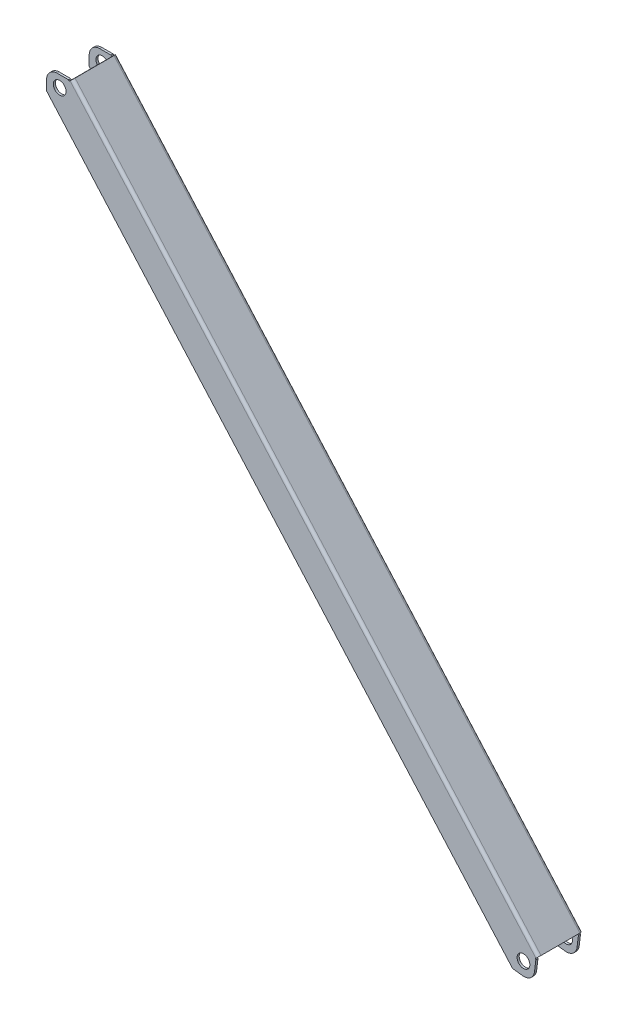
ISO-10303-21;
HEADER;
FILE_DESCRIPTION(('STEP AP214'),'2;1');
FILE_NAME('part.step','',(''),(''),'','','');
FILE_SCHEMA(('AUTOMOTIVE_DESIGN { 1 0 10303 214 1 1 1 1 }'));
ENDSEC;
DATA;
#1=APPLICATION_CONTEXT('core data for automotive mechanical design processes');
#2=APPLICATION_PROTOCOL_DEFINITION('international standard','automotive_design',2000,#1);
#3=PRODUCT_CONTEXT('',#1,'mechanical');
#4=PRODUCT('Part','Part','',(#3));
#5=PRODUCT_RELATED_PRODUCT_CATEGORY('part','',(#4));
#6=PRODUCT_DEFINITION_FORMATION('','',#4);
#7=PRODUCT_DEFINITION_CONTEXT('part definition',#1,'design');
#8=PRODUCT_DEFINITION('design','',#6,#7);
#9=PRODUCT_DEFINITION_SHAPE('','',#8);
#10=(LENGTH_UNIT() NAMED_UNIT(*) SI_UNIT(.MILLI.,.METRE.));
#11=(NAMED_UNIT(*) PLANE_ANGLE_UNIT() SI_UNIT($,.RADIAN.));
#12=(NAMED_UNIT(*) SI_UNIT($,.STERADIAN.) SOLID_ANGLE_UNIT());
#13=UNCERTAINTY_MEASURE_WITH_UNIT(LENGTH_MEASURE(1.E-05),#10,'distance_accuracy_value','');
#14=(GEOMETRIC_REPRESENTATION_CONTEXT(3) GLOBAL_UNCERTAINTY_ASSIGNED_CONTEXT((#13)) GLOBAL_UNIT_ASSIGNED_CONTEXT((#10,
#11,#12)) REPRESENTATION_CONTEXT('',''));
#15=CARTESIAN_POINT('',(0.,0.,0.));
#16=DIRECTION('',(0.,0.,1.));
#17=DIRECTION('',(1.,0.,0.));
#18=AXIS2_PLACEMENT_3D('',#15,#16,#17);
#19=CARTESIAN_POINT('',(248.942582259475,-260.292082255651,0.736600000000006));
#20=DIRECTION('',(0.662453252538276,-0.749103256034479,0.));
#21=DIRECTION('',(0.749103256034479,0.662453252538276,0.));
#22=AXIS2_PLACEMENT_3D('',#19,#20,#21);
#23=PLANE('',#22);
#24=DIRECTION('',(0.749103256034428,0.662453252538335,0.));
#25=VECTOR('',#24,1.);
#26=CARTESIAN_POINT('',(250.992578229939,-258.479212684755,0.736599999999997));
#27=LINE('',#26,#25);
#28=CARTESIAN_POINT('',(249.49437171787,-259.804119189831,0.736600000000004));
#29=VERTEX_POINT('',#28);
#30=CARTESIAN_POINT('',(250.992578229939,-258.479212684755,0.736599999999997));
#31=VERTEX_POINT('',#30);
#32=EDGE_CURVE('E186',#29,#31,#27,.T.);
#33=ORIENTED_EDGE('',*,*,#32,.F.);
#34=CARTESIAN_POINT('',(248.942582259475,-260.292082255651,0.736600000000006));
#35=DIRECTION('',(-0.662453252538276,0.749103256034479,0.));
#36=DIRECTION('',(-0.749103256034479,-0.662453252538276,0.));
#37=AXIS2_PLACEMENT_3D('',#34,#35,#36);
#38=CIRCLE('',#37,0.736599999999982);
#39=CARTESIAN_POINT('',(248.942582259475,-260.292082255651,0.));
#40=VERTEX_POINT('',#39);
#41=EDGE_CURVE('E155',#40,#29,#38,.F.);
#42=ORIENTED_EDGE('',*,*,#41,.F.);
#43=DIRECTION('',(0.,0.,-1.));
#44=VECTOR('',#43,1.);
#45=CARTESIAN_POINT('',(248.942582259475,-260.292082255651,-2.));
#46=LINE('',#45,#44);
#47=CARTESIAN_POINT('',(248.942582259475,-260.292082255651,-2.));
#48=VERTEX_POINT('',#47);
#49=EDGE_CURVE('E182',#40,#48,#46,.T.);
#50=ORIENTED_EDGE('',*,*,#49,.T.);
#51=CARTESIAN_POINT('',(248.942582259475,-260.292082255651,0.736600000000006));
#52=DIRECTION('',(-0.662453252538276,0.749103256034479,0.));
#53=DIRECTION('',(-0.749103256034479,-0.662453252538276,0.));
#54=AXIS2_PLACEMENT_3D('',#51,#52,#53);
#55=CIRCLE('',#54,2.73659999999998);
#56=EDGE_CURVE('E167',#48,#31,#55,.F.);
#57=ORIENTED_EDGE('',*,*,#56,.T.);
#58=EDGE_LOOP('',(#33,#42,#50,#57));
#59=FACE_BOUND('',#58,.T.);
#60=ADVANCED_FACE('F45',(#59),#23,.T.);
#61=CARTESIAN_POINT('',(237.23097171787,-268.57975295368,-2.));
#62=DIRECTION('',(0.,0.,-1.));
#63=DIRECTION('',(-1.,0.,0.));
#64=AXIS2_PLACEMENT_3D('',#61,#62,#63);
#65=CYLINDRICAL_SURFACE('',#64,6.00000000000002);
#66=CARTESIAN_POINT('',(237.23097171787,-268.57975295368,-2.));
#67=DIRECTION('',(0.,0.,1.));
#68=DIRECTION('',(1.,0.,0.));
#69=AXIS2_PLACEMENT_3D('',#66,#67,#68);
#70=CIRCLE('',#69,6.00000000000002);
#71=CARTESIAN_POINT('',(243.23097171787,-268.57975295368,-2.));
#72=VERTEX_POINT('',#71);
#73=EDGE_CURVE('E276',#72,#72,#70,.T.);
#74=ORIENTED_EDGE('',*,*,#73,.F.);
#75=EDGE_LOOP('',(#74));
#76=FACE_BOUND('',#75,.T.);
#77=CARTESIAN_POINT('',(237.23097171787,-268.57975295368,0.));
#78=DIRECTION('',(0.,0.,1.));
#79=DIRECTION('',(1.,0.,0.));
#80=AXIS2_PLACEMENT_3D('',#77,#78,#79);
#81=CIRCLE('',#80,6.00000000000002);
#82=CARTESIAN_POINT('',(243.23097171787,-268.57975295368,0.));
#83=VERTEX_POINT('',#82);
#84=EDGE_CURVE('E151',#83,#83,#81,.T.);
#85=ORIENTED_EDGE('',*,*,#84,.T.);
#86=EDGE_LOOP('',(#85));
#87=FACE_BOUND('',#86,.T.);
#88=ADVANCED_FACE('F720',(#76,#87),#65,.F.);
#89=CARTESIAN_POINT('',(238.415911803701,-269.601115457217,-2.));
#90=DIRECTION('',(0.662453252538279,-0.749103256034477,0.));
#91=DIRECTION('',(-0.749103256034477,-0.662453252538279,0.));
#92=AXIS2_PLACEMENT_3D('',#89,#90,#91);
#93=PLANE('',#92);
#94=ORIENTED_EDGE('',*,*,#49,.F.);
#95=DIRECTION('',(-0.749103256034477,-0.662453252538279,0.));
#96=VECTOR('',#95,1.);
#97=CARTESIAN_POINT('',(238.415911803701,-269.601115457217,0.));
#98=LINE('',#97,#96);
#99=CARTESIAN_POINT('',(248.193479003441,-260.954535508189,0.));
#100=VERTEX_POINT('',#99);
#101=EDGE_CURVE('E286',#40,#100,#98,.T.);
#102=ORIENTED_EDGE('',*,*,#101,.T.);
#103=DIRECTION('',(0.,0.,-1.));
#104=VECTOR('',#103,1.);
#105=CARTESIAN_POINT('',(248.193479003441,-260.954535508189,-2.));
#106=LINE('',#105,#104);
#107=CARTESIAN_POINT('',(248.193479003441,-260.954535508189,-2.));
#108=VERTEX_POINT('',#107);
#109=EDGE_CURVE('E178',#100,#108,#106,.T.);
#110=ORIENTED_EDGE('',*,*,#109,.T.);
#111=DIRECTION('',(-0.749103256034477,-0.662453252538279,0.));
#112=VECTOR('',#111,1.);
#113=CARTESIAN_POINT('',(238.415911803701,-269.601115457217,-2.));
#114=LINE('',#113,#112);
#115=EDGE_CURVE('E256',#48,#108,#114,.T.);
#116=ORIENTED_EDGE('',*,*,#115,.F.);
#117=EDGE_LOOP('',(#94,#102,#110,#116));
#118=FACE_BOUND('',#117,.T.);
#119=ADVANCED_FACE('F727',(#118),#93,.T.);
#120=CARTESIAN_POINT('',(9.77756719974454,8.64657994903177,-2.));
#121=DIRECTION('',(0.749103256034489,0.662453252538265,0.));
#122=DIRECTION('',(0.662453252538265,-0.749103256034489,0.));
#123=AXIS2_PLACEMENT_3D('',#120,#121,#122);
#124=PLANE('',#123);
#125=ORIENTED_EDGE('',*,*,#109,.F.);
#126=DIRECTION('',(0.662453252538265,-0.749103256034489,0.));
#127=VECTOR('',#126,1.);
#128=CARTESIAN_POINT('',(9.77756719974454,8.64657994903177,0.));
#129=LINE('',#128,#127);
#130=CARTESIAN_POINT('',(248.855932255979,-261.703638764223,0.));
#131=VERTEX_POINT('',#130);
#132=EDGE_CURVE('E313',#100,#131,#129,.T.);
#133=ORIENTED_EDGE('',*,*,#132,.T.);
#134=DIRECTION('',(0.,0.,-1.));
#135=VECTOR('',#134,1.);
#136=CARTESIAN_POINT('',(248.855932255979,-261.703638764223,-2.));
#137=LINE('',#136,#135);
#138=CARTESIAN_POINT('',(248.855932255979,-261.703638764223,-2.));
#139=VERTEX_POINT('',#138);
#140=EDGE_CURVE('E174',#131,#139,#137,.T.);
#141=ORIENTED_EDGE('',*,*,#140,.T.);
#142=DIRECTION('',(0.662453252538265,-0.749103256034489,0.));
#143=VECTOR('',#142,1.);
#144=CARTESIAN_POINT('',(9.77756719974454,8.64657994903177,-2.));
#145=LINE('',#144,#143);
#146=EDGE_CURVE('E260',#108,#139,#145,.T.);
#147=ORIENTED_EDGE('',*,*,#146,.F.);
#148=EDGE_LOOP('',(#125,#133,#141,#147));
#149=FACE_BOUND('',#148,.T.);
#150=ADVANCED_FACE('F761',(#149),#124,.T.);
#151=CARTESIAN_POINT('',(276.90202845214,-34.1244824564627,-2.));
#152=DIRECTION('',(-0.992491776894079,0.12231137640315,0.));
#153=DIRECTION('',(0.12231137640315,0.992491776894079,0.));
#154=AXIS2_PLACEMENT_3D('',#151,#152,#153);
#155=PLANE('',#154);
#156=ORIENTED_EDGE('',*,*,#140,.F.);
#157=DIRECTION('',(0.12231137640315,0.992491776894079,0.));
#158=VECTOR('',#157,1.);
#159=CARTESIAN_POINT('',(276.90202845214,-34.1244824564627,0.));
#160=LINE('',#159,#158);
#161=CARTESIAN_POINT('',(247.570470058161,-272.134480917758,0.));
#162=VERTEX_POINT('',#161);
#163=EDGE_CURVE('E309',#162,#131,#160,.T.);
#164=ORIENTED_EDGE('',*,*,#163,.F.);
#165=DIRECTION('',(0.,0.,-1.));
#166=VECTOR('',#165,1.);
#167=CARTESIAN_POINT('',(247.570470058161,-272.134480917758,-2.));
#168=LINE('',#167,#166);
#169=CARTESIAN_POINT('',(247.570470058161,-272.134480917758,-2.));
#170=VERTEX_POINT('',#169);
#171=EDGE_CURVE('E170',#162,#170,#168,.T.);
#172=ORIENTED_EDGE('',*,*,#171,.T.);
#173=DIRECTION('',(0.12231137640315,0.992491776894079,0.));
#174=VECTOR('',#173,1.);
#175=CARTESIAN_POINT('',(276.90202845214,-34.1244824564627,-2.));
#176=LINE('',#175,#174);
#177=EDGE_CURVE('E264',#170,#139,#176,.T.);
#178=ORIENTED_EDGE('',*,*,#177,.T.);
#179=EDGE_LOOP('',(#156,#164,#172,#178));
#180=FACE_BOUND('',#179,.T.);
#181=ADVANCED_FACE('F615',(#180),#155,.F.);
#182=CARTESIAN_POINT('',(237.64555228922,-270.911367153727,-2.));
#183=DIRECTION('',(0.,0.,-1.));
#184=DIRECTION('',(-1.,0.,0.));
#185=AXIS2_PLACEMENT_3D('',#182,#183,#184);
#186=CYLINDRICAL_SURFACE('',#185,10.);
#187=ORIENTED_EDGE('',*,*,#171,.F.);
#188=CARTESIAN_POINT('',(237.64555228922,-270.911367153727,0.));
#189=DIRECTION('',(0.,0.,-1.));
#190=DIRECTION('',(-1.,0.,0.));
#191=AXIS2_PLACEMENT_3D('',#188,#189,#190);
#192=CIRCLE('',#191,10.);
#193=CARTESIAN_POINT('',(236.422438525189,-280.836284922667,0.));
#194=VERTEX_POINT('',#193);
#195=EDGE_CURVE('E305',#162,#194,#192,.T.);
#196=ORIENTED_EDGE('',*,*,#195,.T.);
#197=DIRECTION('',(0.,0.,-1.));
#198=VECTOR('',#197,1.);
#199=CARTESIAN_POINT('',(236.422438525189,-280.836284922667,-2.));
#200=LINE('',#199,#198);
#201=CARTESIAN_POINT('',(236.422438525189,-280.836284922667,-2.));
#202=VERTEX_POINT('',#201);
#203=EDGE_CURVE('E166',#194,#202,#200,.T.);
#204=ORIENTED_EDGE('',*,*,#203,.T.);
#205=CARTESIAN_POINT('',(237.64555228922,-270.911367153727,-2.));
#206=DIRECTION('',(0.,0.,-1.));
#207=DIRECTION('',(-1.,0.,0.));
#208=AXIS2_PLACEMENT_3D('',#205,#206,#207);
#209=CIRCLE('',#208,10.);
#210=EDGE_CURVE('E268',#170,#202,#209,.T.);
#211=ORIENTED_EDGE('',*,*,#210,.F.);
#212=EDGE_LOOP('',(#187,#196,#204,#211));
#213=FACE_BOUND('',#212,.T.);
#214=ADVANCED_FACE('F624',(#213),#186,.T.);
#215=CARTESIAN_POINT('',(-30.5546721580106,-247.934916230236,-2.));
#216=DIRECTION('',(0.12231137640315,0.992491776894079,0.));
#217=DIRECTION('',(0.992491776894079,-0.12231137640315,0.));
#218=AXIS2_PLACEMENT_3D('',#215,#216,#217);
#219=PLANE('',#218);
#220=ORIENTED_EDGE('',*,*,#203,.F.);
#221=DIRECTION('',(0.992491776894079,-0.12231137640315,0.));
#222=VECTOR('',#221,1.);
#223=CARTESIAN_POINT('',(-30.5546721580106,-247.934916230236,0.));
#224=LINE('',#223,#222);
#225=CARTESIAN_POINT('',(227.021274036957,-279.677716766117,0.));
#226=VERTEX_POINT('',#225);
#227=EDGE_CURVE('E156',#226,#194,#224,.T.);
#228=ORIENTED_EDGE('',*,*,#227,.F.);
#229=DIRECTION('',(0.,0.,-1.));
#230=VECTOR('',#229,1.);
#231=CARTESIAN_POINT('',(227.021274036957,-279.677716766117,-2.));
#232=LINE('',#231,#230);
#233=CARTESIAN_POINT('',(227.021274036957,-279.677716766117,-2.));
#234=VERTEX_POINT('',#233);
#235=EDGE_CURVE('E163',#226,#234,#232,.T.);
#236=ORIENTED_EDGE('',*,*,#235,.T.);
#237=DIRECTION('',(0.992491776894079,-0.12231137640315,0.));
#238=VECTOR('',#237,1.);
#239=CARTESIAN_POINT('',(-30.5546721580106,-247.934916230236,-2.));
#240=LINE('',#239,#238);
#241=EDGE_CURVE('E272',#234,#202,#240,.T.);
#242=ORIENTED_EDGE('',*,*,#241,.T.);
#243=EDGE_LOOP('',(#220,#228,#236,#242));
#244=FACE_BOUND('',#243,.T.);
#245=ADVANCED_FACE('F627',(#244),#219,.F.);
#246=CARTESIAN_POINT('',(248.942582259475,-260.292082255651,37.2634));
#247=DIRECTION('',(-0.662453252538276,0.749103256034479,0.));
#248=DIRECTION('',(-0.749103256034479,-0.662453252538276,0.));
#249=AXIS2_PLACEMENT_3D('',#246,#247,#248);
#250=PLANE('',#249);
#251=DIRECTION('',(0.,0.,1.));
#252=VECTOR('',#251,1.);
#253=CARTESIAN_POINT('',(248.942582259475,-260.292082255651,40.));
#254=LINE('',#253,#252);
#255=CARTESIAN_POINT('',(248.942582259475,-260.292082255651,38.));
#256=VERTEX_POINT('',#255);
#257=CARTESIAN_POINT('',(248.942582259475,-260.292082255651,40.));
#258=VERTEX_POINT('',#257);
#259=EDGE_CURVE('E194',#256,#258,#254,.T.);
#260=ORIENTED_EDGE('',*,*,#259,.F.);
#261=CARTESIAN_POINT('',(248.942582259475,-260.292082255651,37.2634));
#262=DIRECTION('',(-0.662453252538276,0.749103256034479,0.));
#263=DIRECTION('',(-0.749103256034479,-0.662453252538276,0.));
#264=AXIS2_PLACEMENT_3D('',#261,#262,#263);
#265=CIRCLE('',#264,0.736599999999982);
#266=CARTESIAN_POINT('',(249.49437171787,-259.804119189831,37.2634));
#267=VERTEX_POINT('',#266);
#268=EDGE_CURVE('E161',#256,#267,#265,.T.);
#269=ORIENTED_EDGE('',*,*,#268,.T.);
#270=DIRECTION('',(0.749103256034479,0.662453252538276,0.));
#271=VECTOR('',#270,1.);
#272=CARTESIAN_POINT('',(250.992578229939,-258.479212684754,37.2634));
#273=LINE('',#272,#271);
#274=CARTESIAN_POINT('',(250.992578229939,-258.479212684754,37.2634));
#275=VERTEX_POINT('',#274);
#276=EDGE_CURVE('E190',#267,#275,#273,.T.);
#277=ORIENTED_EDGE('',*,*,#276,.T.);
#278=CARTESIAN_POINT('',(248.942582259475,-260.292082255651,37.2634));
#279=DIRECTION('',(0.662453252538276,-0.749103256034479,0.));
#280=DIRECTION('',(-0.749103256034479,-0.662453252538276,0.));
#281=AXIS2_PLACEMENT_3D('',#278,#279,#280);
#282=CIRCLE('',#281,2.73659999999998);
#283=EDGE_CURVE('E246',#258,#275,#282,.F.);
#284=ORIENTED_EDGE('',*,*,#283,.F.);
#285=EDGE_LOOP('',(#260,#269,#277,#284));
#286=FACE_BOUND('',#285,.T.);
#287=ADVANCED_FACE('F368',(#286),#250,.F.);
#288=CARTESIAN_POINT('',(237.23097171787,-268.57975295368,40.0000000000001));
#289=DIRECTION('',(0.,0.,1.));
#290=DIRECTION('',(1.,0.,0.));
#291=AXIS2_PLACEMENT_3D('',#288,#289,#290);
#292=CYLINDRICAL_SURFACE('',#291,6.00000000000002);
#293=CARTESIAN_POINT('',(237.23097171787,-268.57975295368,40.0000000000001));
#294=DIRECTION('',(0.,0.,1.));
#295=DIRECTION('',(1.,0.,0.));
#296=AXIS2_PLACEMENT_3D('',#293,#294,#295);
#297=CIRCLE('',#296,6.00000000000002);
#298=CARTESIAN_POINT('',(243.23097171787,-268.57975295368,40.0000000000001));
#299=VERTEX_POINT('',#298);
#300=EDGE_CURVE('E242',#299,#299,#297,.T.);
#301=ORIENTED_EDGE('',*,*,#300,.T.);
#302=EDGE_LOOP('',(#301));
#303=FACE_BOUND('',#302,.T.);
#304=CARTESIAN_POINT('',(237.23097171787,-268.57975295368,38.0000000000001));
#305=DIRECTION('',(0.,0.,1.));
#306=DIRECTION('',(1.,0.,0.));
#307=AXIS2_PLACEMENT_3D('',#304,#305,#306);
#308=CIRCLE('',#307,6.00000000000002);
#309=CARTESIAN_POINT('',(243.23097171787,-268.57975295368,38.0000000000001));
#310=VERTEX_POINT('',#309);
#311=EDGE_CURVE('E157',#310,#310,#308,.T.);
#312=ORIENTED_EDGE('',*,*,#311,.F.);
#313=EDGE_LOOP('',(#312));
#314=FACE_BOUND('',#313,.T.);
#315=ADVANCED_FACE('F47',(#303,#314),#292,.F.);
#316=CARTESIAN_POINT('',(246.347356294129,-282.059398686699,40.0000000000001));
#317=DIRECTION('',(0.12231137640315,0.992491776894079,0.));
#318=DIRECTION('',(-0.992491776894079,0.12231137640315,0.));
#319=AXIS2_PLACEMENT_3D('',#316,#317,#318);
#320=PLANE('',#319);
#321=DIRECTION('',(0.,0.,1.));
#322=VECTOR('',#321,1.);
#323=CARTESIAN_POINT('',(227.021274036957,-279.677716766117,40.0000000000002));
#324=LINE('',#323,#322);
#325=CARTESIAN_POINT('',(227.021274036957,-279.677716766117,38.0000000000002));
#326=VERTEX_POINT('',#325);
#327=CARTESIAN_POINT('',(227.021274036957,-279.677716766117,40.0000000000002));
#328=VERTEX_POINT('',#327);
#329=EDGE_CURVE('E11',#326,#328,#324,.T.);
#330=ORIENTED_EDGE('',*,*,#329,.F.);
#331=DIRECTION('',(-0.992491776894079,0.12231137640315,0.));
#332=VECTOR('',#331,1.);
#333=CARTESIAN_POINT('',(246.347356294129,-282.059398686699,38.0000000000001));
#334=LINE('',#333,#332);
#335=CARTESIAN_POINT('',(236.422438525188,-280.836284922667,38.0000000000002));
#336=VERTEX_POINT('',#335);
#337=EDGE_CURVE('E132',#336,#326,#334,.T.);
#338=ORIENTED_EDGE('',*,*,#337,.F.);
#339=DIRECTION('',(0.,0.,1.));
#340=VECTOR('',#339,1.);
#341=CARTESIAN_POINT('',(236.422438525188,-280.836284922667,40.0000000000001));
#342=LINE('',#341,#340);
#343=CARTESIAN_POINT('',(236.422438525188,-280.836284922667,40.0000000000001));
#344=VERTEX_POINT('',#343);
#345=EDGE_CURVE('E55',#336,#344,#342,.T.);
#346=ORIENTED_EDGE('',*,*,#345,.T.);
#347=DIRECTION('',(-0.992491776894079,0.12231137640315,0.));
#348=VECTOR('',#347,1.);
#349=CARTESIAN_POINT('',(246.347356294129,-282.059398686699,40.0000000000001));
#350=LINE('',#349,#348);
#351=EDGE_CURVE('E139',#344,#328,#350,.T.);
#352=ORIENTED_EDGE('',*,*,#351,.T.);
#353=EDGE_LOOP('',(#330,#338,#346,#352));
#354=FACE_BOUND('',#353,.T.);
#355=ADVANCED_FACE('F137',(#354),#320,.F.);
#356=CARTESIAN_POINT('',(237.64555228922,-270.911367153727,40.0000000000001));
#357=DIRECTION('',(0.,0.,1.));
#358=DIRECTION('',(1.,0.,0.));
#359=AXIS2_PLACEMENT_3D('',#356,#357,#358);
#360=CYLINDRICAL_SURFACE('',#359,10.);
#361=ORIENTED_EDGE('',*,*,#345,.F.);
#362=CARTESIAN_POINT('',(237.64555228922,-270.911367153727,38.0000000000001));
#363=DIRECTION('',(0.,0.,1.));
#364=DIRECTION('',(1.,0.,0.));
#365=AXIS2_PLACEMENT_3D('',#362,#363,#364);
#366=CIRCLE('',#365,10.);
#367=CARTESIAN_POINT('',(247.570470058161,-272.134480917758,38.0000000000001));
#368=VERTEX_POINT('',#367);
#369=EDGE_CURVE('E143',#336,#368,#366,.T.);
#370=ORIENTED_EDGE('',*,*,#369,.T.);
#371=DIRECTION('',(0.,0.,1.));
#372=VECTOR('',#371,1.);
#373=CARTESIAN_POINT('',(247.570470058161,-272.134480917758,40.0000000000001));
#374=LINE('',#373,#372);
#375=CARTESIAN_POINT('',(247.570470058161,-272.134480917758,40.0000000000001));
#376=VERTEX_POINT('',#375);
#377=EDGE_CURVE('E206',#368,#376,#374,.T.);
#378=ORIENTED_EDGE('',*,*,#377,.T.);
#379=CARTESIAN_POINT('',(237.64555228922,-270.911367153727,40.0000000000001));
#380=DIRECTION('',(0.,0.,1.));
#381=DIRECTION('',(1.,0.,0.));
#382=AXIS2_PLACEMENT_3D('',#379,#380,#381);
#383=CIRCLE('',#382,10.);
#384=EDGE_CURVE('E220',#344,#376,#383,.T.);
#385=ORIENTED_EDGE('',*,*,#384,.F.);
#386=EDGE_LOOP('',(#361,#370,#378,#385));
#387=FACE_BOUND('',#386,.T.);
#388=ADVANCED_FACE('F226',(#387),#360,.T.);
#389=CARTESIAN_POINT('',(248.855932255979,-261.703638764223,40.0000000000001));
#390=DIRECTION('',(-0.992491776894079,0.12231137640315,0.));
#391=DIRECTION('',(-0.12231137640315,-0.992491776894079,0.));
#392=AXIS2_PLACEMENT_3D('',#389,#390,#391);
#393=PLANE('',#392);
#394=ORIENTED_EDGE('',*,*,#377,.F.);
#395=DIRECTION('',(-0.12231137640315,-0.992491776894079,0.));
#396=VECTOR('',#395,1.);
#397=CARTESIAN_POINT('',(248.855932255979,-261.703638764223,38.0000000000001));
#398=LINE('',#397,#396);
#399=CARTESIAN_POINT('',(248.855932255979,-261.703638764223,38.));
#400=VERTEX_POINT('',#399);
#401=EDGE_CURVE('E147',#400,#368,#398,.T.);
#402=ORIENTED_EDGE('',*,*,#401,.F.);
#403=DIRECTION('',(0.,0.,1.));
#404=VECTOR('',#403,1.);
#405=CARTESIAN_POINT('',(248.855932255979,-261.703638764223,40.0000000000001));
#406=LINE('',#405,#404);
#407=CARTESIAN_POINT('',(248.855932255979,-261.703638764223,40.0000000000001));
#408=VERTEX_POINT('',#407);
#409=EDGE_CURVE('E202',#400,#408,#406,.T.);
#410=ORIENTED_EDGE('',*,*,#409,.T.);
#411=DIRECTION('',(-0.12231137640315,-0.992491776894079,0.));
#412=VECTOR('',#411,1.);
#413=CARTESIAN_POINT('',(248.855932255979,-261.703638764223,40.0000000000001));
#414=LINE('',#413,#412);
#415=EDGE_CURVE('E228',#408,#376,#414,.T.);
#416=ORIENTED_EDGE('',*,*,#415,.T.);
#417=EDGE_LOOP('',(#394,#402,#410,#416));
#418=FACE_BOUND('',#417,.T.);
#419=ADVANCED_FACE('F340',(#418),#393,.F.);
#420=CARTESIAN_POINT('',(9.77756719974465,8.64657994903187,40.));
#421=DIRECTION('',(-0.749103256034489,-0.662453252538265,0.));
#422=DIRECTION('',(0.662453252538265,-0.749103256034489,0.));
#423=AXIS2_PLACEMENT_3D('',#420,#421,#422);
#424=PLANE('',#423);
#425=ORIENTED_EDGE('',*,*,#409,.F.);
#426=DIRECTION('',(0.662453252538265,-0.749103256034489,0.));
#427=VECTOR('',#426,1.);
#428=CARTESIAN_POINT('',(9.77756719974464,8.64657994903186,38.));
#429=LINE('',#428,#427);
#430=CARTESIAN_POINT('',(248.193479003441,-260.954535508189,38.));
#431=VERTEX_POINT('',#430);
#432=EDGE_CURVE('E333',#431,#400,#429,.T.);
#433=ORIENTED_EDGE('',*,*,#432,.F.);
#434=DIRECTION('',(0.,0.,1.));
#435=VECTOR('',#434,1.);
#436=CARTESIAN_POINT('',(248.193479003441,-260.954535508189,40.));
#437=LINE('',#436,#435);
#438=CARTESIAN_POINT('',(248.193479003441,-260.954535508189,40.));
#439=VERTEX_POINT('',#438);
#440=EDGE_CURVE('E198',#431,#439,#437,.T.);
#441=ORIENTED_EDGE('',*,*,#440,.T.);
#442=DIRECTION('',(0.662453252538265,-0.749103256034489,0.));
#443=VECTOR('',#442,1.);
#444=CARTESIAN_POINT('',(9.77756719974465,8.64657994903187,40.));
#445=LINE('',#444,#443);
#446=EDGE_CURVE('E231',#439,#408,#445,.T.);
#447=ORIENTED_EDGE('',*,*,#446,.T.);
#448=EDGE_LOOP('',(#425,#433,#441,#447));
#449=FACE_BOUND('',#448,.T.);
#450=ADVANCED_FACE('F348',(#449),#424,.F.);
#451=CARTESIAN_POINT('',(238.415911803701,-269.601115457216,40.0000000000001));
#452=DIRECTION('',(-0.662453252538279,0.749103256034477,0.));
#453=DIRECTION('',(-0.749103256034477,-0.662453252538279,0.));
#454=AXIS2_PLACEMENT_3D('',#451,#452,#453);
#455=PLANE('',#454);
#456=ORIENTED_EDGE('',*,*,#440,.F.);
#457=DIRECTION('',(-0.749103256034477,-0.662453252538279,0.));
#458=VECTOR('',#457,1.);
#459=CARTESIAN_POINT('',(238.415911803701,-269.601115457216,38.0000000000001));
#460=LINE('',#459,#458);
#461=EDGE_CURVE('E162',#256,#431,#460,.T.);
#462=ORIENTED_EDGE('',*,*,#461,.F.);
#463=ORIENTED_EDGE('',*,*,#259,.T.);
#464=DIRECTION('',(-0.749103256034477,-0.662453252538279,0.));
#465=VECTOR('',#464,1.);
#466=CARTESIAN_POINT('',(238.415911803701,-269.601115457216,40.0000000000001));
#467=LINE('',#466,#465);
#468=EDGE_CURVE('E238',#258,#439,#467,.T.);
#469=ORIENTED_EDGE('',*,*,#468,.T.);
#470=EDGE_LOOP('',(#456,#462,#463,#469));
#471=FACE_BOUND('',#470,.T.);
#472=ADVANCED_FACE('F353',(#471),#455,.F.);
#473=CARTESIAN_POINT('',(250.992578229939,-258.479212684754,19.));
#474=DIRECTION('',(-0.662453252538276,0.749103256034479,0.));
#475=DIRECTION('',(0.,0.,1.));
#476=AXIS2_PLACEMENT_3D('',#473,#474,#475);
#477=PLANE('',#476);
#478=ORIENTED_EDGE('',*,*,#276,.F.);
#479=DIRECTION('',(0.,0.,1.));
#480=VECTOR('',#479,1.);
#481=CARTESIAN_POINT('',(249.49437171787,-259.804119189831,0.));
#482=LINE('',#481,#480);
#483=EDGE_CURVE('E297',#29,#267,#482,.T.);
#484=ORIENTED_EDGE('',*,*,#483,.F.);
#485=ORIENTED_EDGE('',*,*,#32,.T.);
#486=DIRECTION('',(0.,0.,1.));
#487=VECTOR('',#486,1.);
#488=CARTESIAN_POINT('',(250.992578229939,-258.479212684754,19.));
#489=LINE('',#488,#487);
#490=EDGE_CURVE('E416',#31,#275,#489,.T.);
#491=ORIENTED_EDGE('',*,*,#490,.T.);
#492=EDGE_LOOP('',(#478,#484,#485,#491));
#493=FACE_BOUND('',#492,.T.);
#494=ADVANCED_FACE('F381',(#493),#477,.F.);
#495=CARTESIAN_POINT('',(0.,0.,0.));
#496=DIRECTION('',(0.,0.,-1.));
#497=DIRECTION('',(-1.,0.,0.));
#498=AXIS2_PLACEMENT_3D('',#495,#496,#497);
#499=PLANE('',#498);
#500=DIRECTION('',(-0.662453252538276,0.749103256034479,0.));
#501=VECTOR('',#500,1.);
#502=CARTESIAN_POINT('',(-234.983443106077,286.932283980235,1.35633691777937E-13));
#503=LINE('',#502,#501);
#504=CARTESIAN_POINT('',(-188.758127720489,234.660619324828,0.));
#505=VERTEX_POINT('',#504);
#506=EDGE_CURVE('E283',#505,#40,#503,.F.);
#507=ORIENTED_EDGE('',*,*,#506,.F.);
#508=DIRECTION('',(-0.749103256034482,-0.662453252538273,0.));
#509=VECTOR('',#508,1.);
#510=CARTESIAN_POINT('',(-199.284798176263,225.351586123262,0.));
#511=LINE('',#510,#509);
#512=CARTESIAN_POINT('',(-189.507230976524,233.998166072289,0.));
#513=VERTEX_POINT('',#512);
#514=EDGE_CURVE('E519',#505,#513,#511,.T.);
#515=ORIENTED_EDGE('',*,*,#514,.T.);
#516=DIRECTION('',(-0.662453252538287,0.74910325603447,0.));
#517=VECTOR('',#516,1.);
#518=CARTESIAN_POINT('',(48.9086808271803,-35.6029493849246,0.));
#519=LINE('',#518,#517);
#520=CARTESIAN_POINT('',(-190.169684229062,234.747269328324,0.));
#521=VERTEX_POINT('',#520);
#522=EDGE_CURVE('E542',#513,#521,#519,.T.);
#523=ORIENTED_EDGE('',*,*,#522,.T.);
#524=DIRECTION('',(-1.,0.,0.));
#525=VECTOR('',#524,1.);
#526=CARTESIAN_POINT('',(0.635955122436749,234.747269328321,0.));
#527=LINE('',#526,#525);
#528=CARTESIAN_POINT('',(-200.679435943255,234.747269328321,0.));
#529=VERTEX_POINT('',#528);
#530=EDGE_CURVE('E499',#529,#521,#527,.F.);
#531=ORIENTED_EDGE('',*,*,#530,.F.);
#532=CARTESIAN_POINT('',(-200.679435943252,224.747269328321,0.));
#533=DIRECTION('',(0.,0.,1.));
#534=DIRECTION('',(1.,0.,0.));
#535=AXIS2_PLACEMENT_3D('',#532,#533,#534);
#536=CIRCLE('',#535,10.);
#537=CARTESIAN_POINT('',(-210.679435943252,224.747269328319,0.));
#538=VERTEX_POINT('',#537);
#539=EDGE_CURVE('E525',#529,#538,#536,.T.);
#540=ORIENTED_EDGE('',*,*,#539,.T.);
#541=DIRECTION('',(0.,1.,0.));
#542=VECTOR('',#541,1.);
#543=CARTESIAN_POINT('',(-210.67943594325,-0.719139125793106,0.));
#544=LINE('',#543,#542);
#545=CARTESIAN_POINT('',(-210.67943594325,215.274984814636,0.));
#546=VERTEX_POINT('',#545);
#547=EDGE_CURVE('E480',#546,#538,#544,.T.);
#548=ORIENTED_EDGE('',*,*,#547,.F.);
#549=DIRECTION('',(0.662453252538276,-0.749103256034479,0.));
#550=VECTOR('',#549,1.);
#551=CARTESIAN_POINT('',(-249.032428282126,258.644613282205,0.));
#552=LINE('',#551,#550);
#553=EDGE_CURVE('E287',#546,#226,#552,.T.);
#554=ORIENTED_EDGE('',*,*,#553,.T.);
#555=ORIENTED_EDGE('',*,*,#227,.T.);
#556=ORIENTED_EDGE('',*,*,#195,.F.);
#557=ORIENTED_EDGE('',*,*,#163,.T.);
#558=ORIENTED_EDGE('',*,*,#132,.F.);
#559=ORIENTED_EDGE('',*,*,#101,.F.);
#560=EDGE_LOOP('',(#507,#515,#523,#531,#540,#548,#554,#555,#556,#557,#558,#559));
#561=FACE_BOUND('',#560,.T.);
#562=ORIENTED_EDGE('',*,*,#84,.F.);
#563=EDGE_LOOP('',(#562));
#564=FACE_BOUND('',#563,.T.);
#565=CARTESIAN_POINT('',(-198.416035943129,224.050618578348,0.));
#566=DIRECTION('',(0.,0.,-1.));
#567=DIRECTION('',(-1.,0.,0.));
#568=AXIS2_PLACEMENT_3D('',#565,#566,#567);
#569=CIRCLE('',#568,6.00000000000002);
#570=CARTESIAN_POINT('',(-204.416035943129,224.050618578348,0.));
#571=VERTEX_POINT('',#570);
#572=EDGE_CURVE('E515',#571,#571,#569,.T.);
#573=ORIENTED_EDGE('',*,*,#572,.T.);
#574=EDGE_LOOP('',(#573));
#575=FACE_BOUND('',#574,.T.);
#576=ADVANCED_FACE('F629',(#561,#564,#575),#499,.F.);
#577=CARTESIAN_POINT('',(11.07845991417,9.79699626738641,0.));
#578=DIRECTION('',(0.749103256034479,0.662453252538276,0.));
#579=DIRECTION('',(-0.662453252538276,0.749103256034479,0.));
#580=AXIS2_PLACEMENT_3D('',#577,#578,#579);
#581=PLANE('',#580);
#582=DIRECTION('',(-0.662453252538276,0.749103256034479,0.));
#583=VECTOR('',#582,1.);
#584=CARTESIAN_POINT('',(-234.431653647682,287.420247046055,37.2633999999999));
#585=LINE('',#584,#583);
#586=CARTESIAN_POINT('',(-188.206338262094,235.148582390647,37.2634));
#587=VERTEX_POINT('',#586);
#588=EDGE_CURVE('E292',#267,#587,#585,.T.);
#589=ORIENTED_EDGE('',*,*,#588,.T.);
#590=DIRECTION('',(0.,0.,1.));
#591=VECTOR('',#590,1.);
#592=CARTESIAN_POINT('',(-188.206338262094,235.148582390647,0.));
#593=LINE('',#592,#591);
#594=CARTESIAN_POINT('',(-188.206338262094,235.148582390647,0.736600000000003));
#595=VERTEX_POINT('',#594);
#596=EDGE_CURVE('E520',#595,#587,#593,.T.);
#597=ORIENTED_EDGE('',*,*,#596,.F.);
#598=DIRECTION('',(-0.662453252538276,0.749103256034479,0.));
#599=VECTOR('',#598,1.);
#600=CARTESIAN_POINT('',(11.07845991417,9.79699626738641,0.736600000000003));
#601=LINE('',#600,#599);
#602=EDGE_CURVE('E288',#29,#595,#601,.T.);
#603=ORIENTED_EDGE('',*,*,#602,.F.);
#604=ORIENTED_EDGE('',*,*,#483,.T.);
#605=EDGE_LOOP('',(#589,#597,#603,#604));
#606=FACE_BOUND('',#605,.T.);
#607=ADVANCED_FACE('F379',(#606),#581,.F.);
#608=CARTESIAN_POINT('',(0.,0.,38.0000000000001));
#609=DIRECTION('',(0.,0.,1.));
#610=DIRECTION('',(-1.,0.,0.));
#611=AXIS2_PLACEMENT_3D('',#608,#609,#610);
#612=PLANE('',#611);
#613=DIRECTION('',(0.662453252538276,-0.749103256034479,0.));
#614=VECTOR('',#613,1.);
#615=CARTESIAN_POINT('',(-249.032428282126,258.644613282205,38.0000000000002));
#616=LINE('',#615,#614);
#617=CARTESIAN_POINT('',(-210.67943594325,215.274984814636,38.0000000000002));
#618=VERTEX_POINT('',#617);
#619=EDGE_CURVE('E118',#618,#326,#616,.T.);
#620=ORIENTED_EDGE('',*,*,#619,.F.);
#621=DIRECTION('',(0.,-1.,0.));
#622=VECTOR('',#621,1.);
#623=CARTESIAN_POINT('',(-210.679435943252,-0.719139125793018,38.0000000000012));
#624=LINE('',#623,#622);
#625=CARTESIAN_POINT('',(-210.679435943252,224.747269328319,38.0000000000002));
#626=VERTEX_POINT('',#625);
#627=EDGE_CURVE('E481',#626,#618,#624,.T.);
#628=ORIENTED_EDGE('',*,*,#627,.F.);
#629=CARTESIAN_POINT('',(-200.679435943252,224.747269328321,38.0000000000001));
#630=DIRECTION('',(0.,0.,-1.));
#631=DIRECTION('',(-1.,0.,0.));
#632=AXIS2_PLACEMENT_3D('',#629,#630,#631);
#633=CIRCLE('',#632,10.);
#634=CARTESIAN_POINT('',(-200.679435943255,234.747269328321,38.0000000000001));
#635=VERTEX_POINT('',#634);
#636=EDGE_CURVE('E449',#626,#635,#633,.T.);
#637=ORIENTED_EDGE('',*,*,#636,.T.);
#638=DIRECTION('',(-1.,0.,0.));
#639=VECTOR('',#638,1.);
#640=CARTESIAN_POINT('',(0.635955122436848,234.747269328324,37.999999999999));
#641=LINE('',#640,#639);
#642=CARTESIAN_POINT('',(-190.169684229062,234.747269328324,38.));
#643=VERTEX_POINT('',#642);
#644=EDGE_CURVE('E468',#643,#635,#641,.T.);
#645=ORIENTED_EDGE('',*,*,#644,.F.);
#646=DIRECTION('',(-0.662453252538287,0.74910325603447,0.));
#647=VECTOR('',#646,1.);
#648=CARTESIAN_POINT('',(48.9086808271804,-35.6029493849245,38.));
#649=LINE('',#648,#647);
#650=CARTESIAN_POINT('',(-189.507230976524,233.998166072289,38.));
#651=VERTEX_POINT('',#650);
#652=EDGE_CURVE('E463',#651,#643,#649,.T.);
#653=ORIENTED_EDGE('',*,*,#652,.F.);
#654=DIRECTION('',(-0.749103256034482,-0.662453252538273,0.));
#655=VECTOR('',#654,1.);
#656=CARTESIAN_POINT('',(-199.284798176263,225.351586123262,38.0000000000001));
#657=LINE('',#656,#655);
#658=CARTESIAN_POINT('',(-188.758127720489,234.660619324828,38.));
#659=VERTEX_POINT('',#658);
#660=EDGE_CURVE('E360',#659,#651,#657,.T.);
#661=ORIENTED_EDGE('',*,*,#660,.F.);
#662=DIRECTION('',(-0.662453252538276,0.749103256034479,0.));
#663=VECTOR('',#662,1.);
#664=CARTESIAN_POINT('',(-234.983443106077,286.932283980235,37.9999999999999));
#665=LINE('',#664,#663);
#666=EDGE_CURVE('E133',#659,#256,#665,.F.);
#667=ORIENTED_EDGE('',*,*,#666,.T.);
#668=ORIENTED_EDGE('',*,*,#461,.T.);
#669=ORIENTED_EDGE('',*,*,#432,.T.);
#670=ORIENTED_EDGE('',*,*,#401,.T.);
#671=ORIENTED_EDGE('',*,*,#369,.F.);
#672=ORIENTED_EDGE('',*,*,#337,.T.);
#673=EDGE_LOOP('',(#620,#628,#637,#645,#653,#661,#667,#668,#669,#670,#671,#672));
#674=FACE_BOUND('',#673,.T.);
#675=ORIENTED_EDGE('',*,*,#311,.T.);
#676=EDGE_LOOP('',(#675));
#677=FACE_BOUND('',#676,.T.);
#678=CARTESIAN_POINT('',(-198.416035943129,224.050618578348,38.0000000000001));
#679=DIRECTION('',(0.,0.,-1.));
#680=DIRECTION('',(-1.,0.,0.));
#681=AXIS2_PLACEMENT_3D('',#678,#679,#680);
#682=CIRCLE('',#681,6.00000000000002);
#683=CARTESIAN_POINT('',(-204.416035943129,224.050618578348,38.0000000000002));
#684=VERTEX_POINT('',#683);
#685=EDGE_CURVE('E509',#684,#684,#682,.T.);
#686=ORIENTED_EDGE('',*,*,#685,.F.);
#687=EDGE_LOOP('',(#686));
#688=FACE_BOUND('',#687,.T.);
#689=ADVANCED_FACE('F140',(#674,#677,#688),#612,.F.);
#690=CARTESIAN_POINT('',(-234.983443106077,286.932283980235,37.2633999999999));
#691=DIRECTION('',(-0.662453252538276,0.749103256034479,0.));
#692=DIRECTION('',(0.749103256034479,0.662453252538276,0.));
#693=AXIS2_PLACEMENT_3D('',#690,#691,#692);
#694=CYLINDRICAL_SURFACE('',#693,0.736599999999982);
#695=ORIENTED_EDGE('',*,*,#666,.F.);
#696=CARTESIAN_POINT('',(-188.758127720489,234.660619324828,37.2633999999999));
#697=DIRECTION('',(-0.662453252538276,0.749103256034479,0.));
#698=DIRECTION('',(-0.749103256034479,-0.662453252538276,0.));
#699=AXIS2_PLACEMENT_3D('',#696,#697,#698);
#700=CIRCLE('',#699,0.736599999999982);
#701=EDGE_CURVE('E372',#659,#587,#700,.T.);
#702=ORIENTED_EDGE('',*,*,#701,.T.);
#703=ORIENTED_EDGE('',*,*,#588,.F.);
#704=ORIENTED_EDGE('',*,*,#268,.F.);
#705=EDGE_LOOP('',(#695,#702,#703,#704));
#706=FACE_BOUND('',#705,.T.);
#707=ADVANCED_FACE('F370',(#706),#694,.F.);
#708=CARTESIAN_POINT('',(-234.983443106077,286.932283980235,0.736600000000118));
#709=DIRECTION('',(-0.662453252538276,0.749103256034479,0.));
#710=DIRECTION('',(0.749103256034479,0.662453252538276,0.));
#711=AXIS2_PLACEMENT_3D('',#708,#709,#710);
#712=CYLINDRICAL_SURFACE('',#711,0.736599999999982);
#713=ORIENTED_EDGE('',*,*,#602,.T.);
#714=CARTESIAN_POINT('',(-188.758127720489,234.660619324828,0.736600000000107));
#715=DIRECTION('',(-0.662453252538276,0.749103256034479,0.));
#716=DIRECTION('',(-0.749103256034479,-0.662453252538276,0.));
#717=AXIS2_PLACEMENT_3D('',#714,#715,#716);
#718=CIRCLE('',#717,0.736599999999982);
#719=EDGE_CURVE('E552',#505,#595,#718,.F.);
#720=ORIENTED_EDGE('',*,*,#719,.F.);
#721=ORIENTED_EDGE('',*,*,#506,.T.);
#722=ORIENTED_EDGE('',*,*,#41,.T.);
#723=EDGE_LOOP('',(#713,#720,#721,#722));
#724=FACE_BOUND('',#723,.T.);
#725=ADVANCED_FACE('F387',(#724),#712,.F.);
#726=CARTESIAN_POINT('',(0.,0.,-2.));
#727=DIRECTION('',(0.,0.,-1.));
#728=DIRECTION('',(-1.,0.,0.));
#729=AXIS2_PLACEMENT_3D('',#726,#727,#728);
#730=PLANE('',#729);
#731=DIRECTION('',(0.662453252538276,-0.749103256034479,0.));
#732=VECTOR('',#731,1.);
#733=CARTESIAN_POINT('',(-249.032428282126,258.644613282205,-2.));
#734=LINE('',#733,#732);
#735=CARTESIAN_POINT('',(-210.67943594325,215.274984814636,-2.));
#736=VERTEX_POINT('',#735);
#737=EDGE_CURVE('E63',#736,#234,#734,.T.);
#738=ORIENTED_EDGE('',*,*,#737,.F.);
#739=DIRECTION('',(-2.34756658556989E-13,1.,0.));
#740=VECTOR('',#739,1.);
#741=CARTESIAN_POINT('',(-210.679435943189,-44.2495293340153,-2.));
#742=LINE('',#741,#740);
#743=CARTESIAN_POINT('',(-210.679435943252,224.747269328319,-2.));
#744=VERTEX_POINT('',#743);
#745=EDGE_CURVE('E558',#736,#744,#742,.T.);
#746=ORIENTED_EDGE('',*,*,#745,.T.);
#747=CARTESIAN_POINT('',(-200.679435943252,224.747269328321,-2.));
#748=DIRECTION('',(0.,0.,1.));
#749=DIRECTION('',(-0.122311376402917,-0.992491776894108,0.));
#750=AXIS2_PLACEMENT_3D('',#747,#748,#749);
#751=CIRCLE('',#750,10.);
#752=CARTESIAN_POINT('',(-200.679435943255,234.747269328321,-2.));
#753=VERTEX_POINT('',#752);
#754=EDGE_CURVE('E493',#753,#744,#751,.T.);
#755=ORIENTED_EDGE('',*,*,#754,.F.);
#756=DIRECTION('',(1.,2.34395836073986E-13,0.));
#757=VECTOR('',#756,1.);
#758=CARTESIAN_POINT('',(39.1311136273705,234.747269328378,-2.));
#759=LINE('',#758,#757);
#760=CARTESIAN_POINT('',(-190.169684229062,234.747269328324,-2.));
#761=VERTEX_POINT('',#760);
#762=EDGE_CURVE('E568',#753,#761,#759,.T.);
#763=ORIENTED_EDGE('',*,*,#762,.T.);
#764=DIRECTION('',(-0.662453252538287,0.74910325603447,0.));
#765=VECTOR('',#764,1.);
#766=CARTESIAN_POINT('',(48.9086808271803,-35.6029493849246,-2.));
#767=LINE('',#766,#765);
#768=CARTESIAN_POINT('',(-189.507230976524,233.998166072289,-2.));
#769=VERTEX_POINT('',#768);
#770=EDGE_CURVE('E503',#769,#761,#767,.T.);
#771=ORIENTED_EDGE('',*,*,#770,.F.);
#772=DIRECTION('',(-0.749103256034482,-0.662453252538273,0.));
#773=VECTOR('',#772,1.);
#774=CARTESIAN_POINT('',(-199.284798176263,225.351586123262,-2.));
#775=LINE('',#774,#773);
#776=CARTESIAN_POINT('',(-188.758127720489,234.660619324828,-2.));
#777=VERTEX_POINT('',#776);
#778=EDGE_CURVE('E508',#777,#769,#775,.T.);
#779=ORIENTED_EDGE('',*,*,#778,.F.);
#780=DIRECTION('',(-0.662453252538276,0.749103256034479,0.));
#781=VECTOR('',#780,1.);
#782=CARTESIAN_POINT('',(-234.983443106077,286.932283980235,-1.99999999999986));
#783=LINE('',#782,#781);
#784=EDGE_CURVE('E252',#777,#48,#783,.F.);
#785=ORIENTED_EDGE('',*,*,#784,.T.);
#786=ORIENTED_EDGE('',*,*,#115,.T.);
#787=ORIENTED_EDGE('',*,*,#146,.T.);
#788=ORIENTED_EDGE('',*,*,#177,.F.);
#789=ORIENTED_EDGE('',*,*,#210,.T.);
#790=ORIENTED_EDGE('',*,*,#241,.F.);
#791=EDGE_LOOP('',(#738,#746,#755,#763,#771,#779,#785,#786,#787,#788,#789,#790));
#792=FACE_BOUND('',#791,.T.);
#793=ORIENTED_EDGE('',*,*,#73,.T.);
#794=EDGE_LOOP('',(#793));
#795=FACE_BOUND('',#794,.T.);
#796=CARTESIAN_POINT('',(-198.416035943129,224.050618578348,-2.));
#797=DIRECTION('',(0.,0.,-1.));
#798=DIRECTION('',(0.122311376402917,0.992491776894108,0.));
#799=AXIS2_PLACEMENT_3D('',#796,#797,#798);
#800=CIRCLE('',#799,6.00000000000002);
#801=CARTESIAN_POINT('',(-197.682167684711,230.005569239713,-2.));
#802=VERTEX_POINT('',#801);
#803=EDGE_CURVE('E513',#802,#802,#800,.T.);
#804=ORIENTED_EDGE('',*,*,#803,.F.);
#805=EDGE_LOOP('',(#804));
#806=FACE_BOUND('',#805,.T.);
#807=ADVANCED_FACE('F620',(#792,#795,#806),#730,.T.);
#808=CARTESIAN_POINT('',(12.5766664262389,11.121902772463,0.));
#809=DIRECTION('',(0.749103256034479,0.662453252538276,0.));
#810=DIRECTION('',(-0.662453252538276,0.749103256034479,0.));
#811=AXIS2_PLACEMENT_3D('',#808,#809,#810);
#812=PLANE('',#811);
#813=DIRECTION('',(-0.662453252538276,0.749103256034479,0.));
#814=VECTOR('',#813,1.);
#815=CARTESIAN_POINT('',(12.5766664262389,11.121902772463,0.736600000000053));
#816=LINE('',#815,#814);
#817=CARTESIAN_POINT('',(-186.708131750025,236.473488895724,0.736599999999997));
#818=VERTEX_POINT('',#817);
#819=EDGE_CURVE('E323',#31,#818,#816,.T.);
#820=ORIENTED_EDGE('',*,*,#819,.T.);
#821=DIRECTION('',(0.,0.,1.));
#822=VECTOR('',#821,1.);
#823=CARTESIAN_POINT('',(-186.708131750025,236.473488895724,19.));
#824=LINE('',#823,#822);
#825=CARTESIAN_POINT('',(-186.708131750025,236.473488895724,37.2634));
#826=VERTEX_POINT('',#825);
#827=EDGE_CURVE('E419',#818,#826,#824,.T.);
#828=ORIENTED_EDGE('',*,*,#827,.T.);
#829=DIRECTION('',(-0.662453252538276,0.749103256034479,0.));
#830=VECTOR('',#829,1.);
#831=CARTESIAN_POINT('',(12.576666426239,11.1219027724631,37.2634));
#832=LINE('',#831,#830);
#833=EDGE_CURVE('E412',#275,#826,#832,.T.);
#834=ORIENTED_EDGE('',*,*,#833,.F.);
#835=ORIENTED_EDGE('',*,*,#490,.F.);
#836=EDGE_LOOP('',(#820,#828,#834,#835));
#837=FACE_BOUND('',#836,.T.);
#838=ADVANCED_FACE('F597',(#837),#812,.T.);
#839=CARTESIAN_POINT('',(1.09850161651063E-13,0.,40.0000000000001));
#840=DIRECTION('',(0.,0.,1.));
#841=DIRECTION('',(-1.,0.,0.));
#842=AXIS2_PLACEMENT_3D('',#839,#840,#841);
#843=PLANE('',#842);
#844=DIRECTION('',(-0.662453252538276,0.749103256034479,0.));
#845=VECTOR('',#844,1.);
#846=CARTESIAN_POINT('',(-234.983443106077,286.932283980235,39.9999999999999));
#847=LINE('',#846,#845);
#848=CARTESIAN_POINT('',(-188.758127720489,234.660619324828,40.));
#849=VERTEX_POINT('',#848);
#850=EDGE_CURVE('E424',#849,#258,#847,.F.);
#851=ORIENTED_EDGE('',*,*,#850,.F.);
#852=DIRECTION('',(-0.749103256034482,-0.662453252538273,0.));
#853=VECTOR('',#852,1.);
#854=CARTESIAN_POINT('',(-199.284798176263,225.351586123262,40.0000000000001));
#855=LINE('',#854,#853);
#856=CARTESIAN_POINT('',(-189.507230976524,233.998166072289,40.));
#857=VERTEX_POINT('',#856);
#858=EDGE_CURVE('E440',#849,#857,#855,.T.);
#859=ORIENTED_EDGE('',*,*,#858,.T.);
#860=DIRECTION('',(-0.662453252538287,0.74910325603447,0.));
#861=VECTOR('',#860,1.);
#862=CARTESIAN_POINT('',(48.9086808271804,-35.6029493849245,40.));
#863=LINE('',#862,#861);
#864=CARTESIAN_POINT('',(-190.169684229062,234.747269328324,40.0000000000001));
#865=VERTEX_POINT('',#864);
#866=EDGE_CURVE('E592',#857,#865,#863,.T.);
#867=ORIENTED_EDGE('',*,*,#866,.T.);
#868=DIRECTION('',(-1.,-2.34395836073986E-13,0.));
#869=VECTOR('',#868,1.);
#870=CARTESIAN_POINT('',(-190.169684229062,234.747269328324,40.0000000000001));
#871=LINE('',#870,#869);
#872=CARTESIAN_POINT('',(-200.679435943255,234.747269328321,40.0000000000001));
#873=VERTEX_POINT('',#872);
#874=EDGE_CURVE('E585',#865,#873,#871,.T.);
#875=ORIENTED_EDGE('',*,*,#874,.T.);
#876=CARTESIAN_POINT('',(-200.679435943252,224.747269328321,40.0000000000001));
#877=DIRECTION('',(0.,0.,-1.));
#878=DIRECTION('',(0.122311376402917,0.992491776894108,0.));
#879=AXIS2_PLACEMENT_3D('',#876,#877,#878);
#880=CIRCLE('',#879,10.);
#881=CARTESIAN_POINT('',(-210.679435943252,224.747269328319,40.0000000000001));
#882=VERTEX_POINT('',#881);
#883=EDGE_CURVE('E477',#882,#873,#880,.T.);
#884=ORIENTED_EDGE('',*,*,#883,.F.);
#885=DIRECTION('',(2.34770536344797E-13,-1.,0.));
#886=VECTOR('',#885,1.);
#887=CARTESIAN_POINT('',(-210.679435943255,234.747269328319,40.0000000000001));
#888=LINE('',#887,#886);
#889=CARTESIAN_POINT('',(-210.67943594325,215.274984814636,40.0000000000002));
#890=VERTEX_POINT('',#889);
#891=EDGE_CURVE('E582',#882,#890,#888,.T.);
#892=ORIENTED_EDGE('',*,*,#891,.T.);
#893=DIRECTION('',(0.662453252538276,-0.749103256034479,0.));
#894=VECTOR('',#893,1.);
#895=CARTESIAN_POINT('',(-249.032428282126,258.644613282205,40.0000000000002));
#896=LINE('',#895,#894);
#897=EDGE_CURVE('E223',#890,#328,#896,.T.);
#898=ORIENTED_EDGE('',*,*,#897,.T.);
#899=ORIENTED_EDGE('',*,*,#351,.F.);
#900=ORIENTED_EDGE('',*,*,#384,.T.);
#901=ORIENTED_EDGE('',*,*,#415,.F.);
#902=ORIENTED_EDGE('',*,*,#446,.F.);
#903=ORIENTED_EDGE('',*,*,#468,.F.);
#904=EDGE_LOOP('',(#851,#859,#867,#875,#884,#892,#898,#899,#900,#901,#902,#903));
#905=FACE_BOUND('',#904,.T.);
#906=ORIENTED_EDGE('',*,*,#300,.F.);
#907=EDGE_LOOP('',(#906));
#908=FACE_BOUND('',#907,.T.);
#909=CARTESIAN_POINT('',(-198.416035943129,224.050618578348,40.0000000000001));
#910=DIRECTION('',(0.,0.,-1.));
#911=DIRECTION('',(0.122311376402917,0.992491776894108,0.));
#912=AXIS2_PLACEMENT_3D('',#909,#910,#911);
#913=CIRCLE('',#912,6.00000000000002);
#914=CARTESIAN_POINT('',(-197.682167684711,230.005569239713,40.0000000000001));
#915=VERTEX_POINT('',#914);
#916=EDGE_CURVE('E578',#915,#915,#913,.T.);
#917=ORIENTED_EDGE('',*,*,#916,.T.);
#918=EDGE_LOOP('',(#917));
#919=FACE_BOUND('',#918,.T.);
#920=ADVANCED_FACE('F217',(#905,#908,#919),#843,.T.);
#921=CARTESIAN_POINT('',(-234.983443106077,286.932283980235,37.2633999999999));
#922=DIRECTION('',(-0.662453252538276,0.749103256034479,0.));
#923=DIRECTION('',(0.749103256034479,0.662453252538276,0.));
#924=AXIS2_PLACEMENT_3D('',#921,#922,#923);
#925=CYLINDRICAL_SURFACE('',#924,2.73659999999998);
#926=ORIENTED_EDGE('',*,*,#833,.T.);
#927=CARTESIAN_POINT('',(-188.758127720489,234.660619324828,37.2634));
#928=DIRECTION('',(0.662453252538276,-0.749103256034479,0.));
#929=DIRECTION('',(-0.749103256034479,-0.662453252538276,0.));
#930=AXIS2_PLACEMENT_3D('',#927,#928,#929);
#931=CIRCLE('',#930,2.73659999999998);
#932=EDGE_CURVE('E433',#849,#826,#931,.F.);
#933=ORIENTED_EDGE('',*,*,#932,.F.);
#934=ORIENTED_EDGE('',*,*,#850,.T.);
#935=ORIENTED_EDGE('',*,*,#283,.T.);
#936=EDGE_LOOP('',(#926,#933,#934,#935));
#937=FACE_BOUND('',#936,.T.);
#938=ADVANCED_FACE('F430',(#937),#925,.T.);
#939=CARTESIAN_POINT('',(-234.983443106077,286.932283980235,0.736600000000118));
#940=DIRECTION('',(-0.662453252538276,0.749103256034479,0.));
#941=DIRECTION('',(0.749103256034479,0.662453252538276,0.));
#942=AXIS2_PLACEMENT_3D('',#939,#940,#941);
#943=CYLINDRICAL_SURFACE('',#942,2.73659999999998);
#944=ORIENTED_EDGE('',*,*,#784,.F.);
#945=CARTESIAN_POINT('',(-188.758127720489,234.660619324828,0.736600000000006));
#946=DIRECTION('',(-0.662453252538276,0.749103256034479,0.));
#947=DIRECTION('',(-0.749103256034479,-0.662453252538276,0.));
#948=AXIS2_PLACEMENT_3D('',#945,#946,#947);
#949=CIRCLE('',#948,2.73659999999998);
#950=EDGE_CURVE('E406',#777,#818,#949,.F.);
#951=ORIENTED_EDGE('',*,*,#950,.T.);
#952=ORIENTED_EDGE('',*,*,#819,.F.);
#953=ORIENTED_EDGE('',*,*,#56,.F.);
#954=EDGE_LOOP('',(#944,#951,#952,#953));
#955=FACE_BOUND('',#954,.T.);
#956=ADVANCED_FACE('F403',(#955),#943,.T.);
#957=CARTESIAN_POINT('',(-249.032428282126,258.644613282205,-2.));
#958=DIRECTION('',(0.749103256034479,0.662453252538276,0.));
#959=DIRECTION('',(0.662453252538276,-0.749103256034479,0.));
#960=AXIS2_PLACEMENT_3D('',#957,#958,#959);
#961=PLANE('',#960);
#962=ORIENTED_EDGE('',*,*,#553,.F.);
#963=DIRECTION('',(0.,0.,-1.));
#964=VECTOR('',#963,1.);
#965=CARTESIAN_POINT('',(-210.67943594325,215.274984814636,-2.));
#966=LINE('',#965,#964);
#967=EDGE_CURVE('E482',#546,#736,#966,.T.);
#968=ORIENTED_EDGE('',*,*,#967,.T.);
#969=ORIENTED_EDGE('',*,*,#737,.T.);
#970=ORIENTED_EDGE('',*,*,#235,.F.);
#971=EDGE_LOOP('',(#962,#968,#969,#970));
#972=FACE_BOUND('',#971,.T.);
#973=ADVANCED_FACE('F635',(#972),#961,.F.);
#974=CARTESIAN_POINT('',(-249.032428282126,258.644613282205,40.0000000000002));
#975=DIRECTION('',(-0.749103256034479,-0.662453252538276,0.));
#976=DIRECTION('',(0.662453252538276,-0.749103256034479,0.));
#977=AXIS2_PLACEMENT_3D('',#974,#975,#976);
#978=PLANE('',#977);
#979=ORIENTED_EDGE('',*,*,#897,.F.);
#980=DIRECTION('',(0.,0.,1.));
#981=VECTOR('',#980,1.);
#982=CARTESIAN_POINT('',(-210.67943594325,215.274984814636,40.0000000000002));
#983=LINE('',#982,#981);
#984=EDGE_CURVE('E126',#618,#890,#983,.T.);
#985=ORIENTED_EDGE('',*,*,#984,.F.);
#986=ORIENTED_EDGE('',*,*,#619,.T.);
#987=ORIENTED_EDGE('',*,*,#329,.T.);
#988=EDGE_LOOP('',(#979,#985,#986,#987));
#989=FACE_BOUND('',#988,.T.);
#990=ADVANCED_FACE('F121',(#989),#978,.T.);
#991=CARTESIAN_POINT('',(-188.758127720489,234.660619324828,37.2634));
#992=DIRECTION('',(-0.662453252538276,0.749103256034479,0.));
#993=DIRECTION('',(-0.749103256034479,-0.662453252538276,0.));
#994=AXIS2_PLACEMENT_3D('',#991,#992,#993);
#995=PLANE('',#994);
#996=DIRECTION('',(0.749103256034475,0.662453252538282,0.));
#997=VECTOR('',#996,1.);
#998=CARTESIAN_POINT('',(-186.708131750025,236.473488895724,37.2634));
#999=LINE('',#998,#997);
#1000=EDGE_CURVE('E293',#587,#826,#999,.T.);
#1001=ORIENTED_EDGE('',*,*,#1000,.F.);
#1002=ORIENTED_EDGE('',*,*,#701,.F.);
#1003=DIRECTION('',(0.,0.,1.));
#1004=VECTOR('',#1003,1.);
#1005=CARTESIAN_POINT('',(-188.758127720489,234.660619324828,40.));
#1006=LINE('',#1005,#1004);
#1007=EDGE_CURVE('E444',#659,#849,#1006,.T.);
#1008=ORIENTED_EDGE('',*,*,#1007,.T.);
#1009=ORIENTED_EDGE('',*,*,#932,.T.);
#1010=EDGE_LOOP('',(#1001,#1002,#1008,#1009));
#1011=FACE_BOUND('',#1010,.T.);
#1012=ADVANCED_FACE('F445',(#1011),#995,.T.);
#1013=CARTESIAN_POINT('',(-199.284798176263,225.351586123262,40.0000000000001));
#1014=DIRECTION('',(-0.662453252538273,0.749103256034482,0.));
#1015=DIRECTION('',(-0.749103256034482,-0.662453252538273,0.));
#1016=AXIS2_PLACEMENT_3D('',#1013,#1014,#1015);
#1017=PLANE('',#1016);
#1018=ORIENTED_EDGE('',*,*,#1007,.F.);
#1019=ORIENTED_EDGE('',*,*,#660,.T.);
#1020=DIRECTION('',(0.,0.,1.));
#1021=VECTOR('',#1020,1.);
#1022=CARTESIAN_POINT('',(-189.507230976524,233.998166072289,40.));
#1023=LINE('',#1022,#1021);
#1024=EDGE_CURVE('E459',#651,#857,#1023,.T.);
#1025=ORIENTED_EDGE('',*,*,#1024,.T.);
#1026=ORIENTED_EDGE('',*,*,#858,.F.);
#1027=EDGE_LOOP('',(#1018,#1019,#1025,#1026));
#1028=FACE_BOUND('',#1027,.T.);
#1029=ADVANCED_FACE('F711',(#1028),#1017,.T.);
#1030=CARTESIAN_POINT('',(48.9086808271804,-35.6029493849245,40.));
#1031=DIRECTION('',(0.74910325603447,0.662453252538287,0.));
#1032=DIRECTION('',(-0.662453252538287,0.74910325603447,0.));
#1033=AXIS2_PLACEMENT_3D('',#1030,#1031,#1032);
#1034=PLANE('',#1033);
#1035=ORIENTED_EDGE('',*,*,#1024,.F.);
#1036=ORIENTED_EDGE('',*,*,#652,.T.);
#1037=DIRECTION('',(0.,0.,1.));
#1038=VECTOR('',#1037,1.);
#1039=CARTESIAN_POINT('',(-190.169684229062,234.747269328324,40.0000000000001));
#1040=LINE('',#1039,#1038);
#1041=EDGE_CURVE('E464',#643,#865,#1040,.T.);
#1042=ORIENTED_EDGE('',*,*,#1041,.T.);
#1043=ORIENTED_EDGE('',*,*,#866,.F.);
#1044=EDGE_LOOP('',(#1035,#1036,#1042,#1043));
#1045=FACE_BOUND('',#1044,.T.);
#1046=ADVANCED_FACE('F710',(#1045),#1034,.T.);
#1047=CARTESIAN_POINT('',(-190.169684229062,234.747269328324,40.0000000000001));
#1048=DIRECTION('',(-2.34395836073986E-13,1.,0.));
#1049=DIRECTION('',(-1.,-2.34395836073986E-13,0.));
#1050=AXIS2_PLACEMENT_3D('',#1047,#1048,#1049);
#1051=PLANE('',#1050);
#1052=ORIENTED_EDGE('',*,*,#1041,.F.);
#1053=ORIENTED_EDGE('',*,*,#644,.T.);
#1054=DIRECTION('',(0.,0.,1.));
#1055=VECTOR('',#1054,1.);
#1056=CARTESIAN_POINT('',(-200.679435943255,234.747269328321,40.0000000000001));
#1057=LINE('',#1056,#1055);
#1058=EDGE_CURVE('E469',#635,#873,#1057,.T.);
#1059=ORIENTED_EDGE('',*,*,#1058,.T.);
#1060=ORIENTED_EDGE('',*,*,#874,.F.);
#1061=EDGE_LOOP('',(#1052,#1053,#1059,#1060));
#1062=FACE_BOUND('',#1061,.T.);
#1063=ADVANCED_FACE('F708',(#1062),#1051,.T.);
#1064=CARTESIAN_POINT('',(-200.679435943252,224.747269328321,40.0000000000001));
#1065=DIRECTION('',(0.,0.,1.));
#1066=DIRECTION('',(1.,0.,0.));
#1067=AXIS2_PLACEMENT_3D('',#1064,#1065,#1066);
#1068=CYLINDRICAL_SURFACE('',#1067,10.);
#1069=ORIENTED_EDGE('',*,*,#1058,.F.);
#1070=ORIENTED_EDGE('',*,*,#636,.F.);
#1071=DIRECTION('',(0.,0.,1.));
#1072=VECTOR('',#1071,1.);
#1073=CARTESIAN_POINT('',(-210.679435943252,224.747269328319,40.0000000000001));
#1074=LINE('',#1073,#1072);
#1075=EDGE_CURVE('E473',#626,#882,#1074,.T.);
#1076=ORIENTED_EDGE('',*,*,#1075,.T.);
#1077=ORIENTED_EDGE('',*,*,#883,.T.);
#1078=EDGE_LOOP('',(#1069,#1070,#1076,#1077));
#1079=FACE_BOUND('',#1078,.T.);
#1080=ADVANCED_FACE('F705',(#1079),#1068,.T.);
#1081=CARTESIAN_POINT('',(-210.679435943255,234.747269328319,40.0000000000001));
#1082=DIRECTION('',(-1.,-2.34770536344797E-13,0.));
#1083=DIRECTION('',(2.34770536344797E-13,-1.,0.));
#1084=AXIS2_PLACEMENT_3D('',#1081,#1082,#1083);
#1085=PLANE('',#1084);
#1086=ORIENTED_EDGE('',*,*,#1075,.F.);
#1087=ORIENTED_EDGE('',*,*,#627,.T.);
#1088=ORIENTED_EDGE('',*,*,#984,.T.);
#1089=ORIENTED_EDGE('',*,*,#891,.F.);
#1090=EDGE_LOOP('',(#1086,#1087,#1088,#1089));
#1091=FACE_BOUND('',#1090,.T.);
#1092=ADVANCED_FACE('F700',(#1091),#1085,.T.);
#1093=CARTESIAN_POINT('',(-210.679435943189,-44.2495293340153,-2.));
#1094=DIRECTION('',(-1.,-2.34756658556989E-13,0.));
#1095=DIRECTION('',(-2.34756658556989E-13,1.,0.));
#1096=AXIS2_PLACEMENT_3D('',#1093,#1094,#1095);
#1097=PLANE('',#1096);
#1098=ORIENTED_EDGE('',*,*,#967,.F.);
#1099=ORIENTED_EDGE('',*,*,#547,.T.);
#1100=DIRECTION('',(0.,0.,-1.));
#1101=VECTOR('',#1100,1.);
#1102=CARTESIAN_POINT('',(-210.679435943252,224.747269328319,-2.));
#1103=LINE('',#1102,#1101);
#1104=EDGE_CURVE('E485',#538,#744,#1103,.T.);
#1105=ORIENTED_EDGE('',*,*,#1104,.T.);
#1106=ORIENTED_EDGE('',*,*,#745,.F.);
#1107=EDGE_LOOP('',(#1098,#1099,#1105,#1106));
#1108=FACE_BOUND('',#1107,.T.);
#1109=ADVANCED_FACE('F641',(#1108),#1097,.T.);
#1110=CARTESIAN_POINT('',(-200.679435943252,224.747269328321,-2.));
#1111=DIRECTION('',(0.,0.,-1.));
#1112=DIRECTION('',(-1.,0.,0.));
#1113=AXIS2_PLACEMENT_3D('',#1110,#1111,#1112);
#1114=CYLINDRICAL_SURFACE('',#1113,10.);
#1115=ORIENTED_EDGE('',*,*,#1104,.F.);
#1116=ORIENTED_EDGE('',*,*,#539,.F.);
#1117=DIRECTION('',(0.,0.,-1.));
#1118=VECTOR('',#1117,1.);
#1119=CARTESIAN_POINT('',(-200.679435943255,234.747269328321,-2.));
#1120=LINE('',#1119,#1118);
#1121=EDGE_CURVE('E489',#529,#753,#1120,.T.);
#1122=ORIENTED_EDGE('',*,*,#1121,.T.);
#1123=ORIENTED_EDGE('',*,*,#754,.T.);
#1124=EDGE_LOOP('',(#1115,#1116,#1122,#1123));
#1125=FACE_BOUND('',#1124,.T.);
#1126=ADVANCED_FACE('F647',(#1125),#1114,.T.);
#1127=CARTESIAN_POINT('',(39.1311136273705,234.747269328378,-2.));
#1128=DIRECTION('',(-2.34395836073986E-13,1.,0.));
#1129=DIRECTION('',(1.,2.34395836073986E-13,0.));
#1130=AXIS2_PLACEMENT_3D('',#1127,#1128,#1129);
#1131=PLANE('',#1130);
#1132=ORIENTED_EDGE('',*,*,#1121,.F.);
#1133=ORIENTED_EDGE('',*,*,#530,.T.);
#1134=DIRECTION('',(0.,0.,-1.));
#1135=VECTOR('',#1134,1.);
#1136=CARTESIAN_POINT('',(-190.169684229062,234.747269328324,-2.));
#1137=LINE('',#1136,#1135);
#1138=EDGE_CURVE('E494',#521,#761,#1137,.T.);
#1139=ORIENTED_EDGE('',*,*,#1138,.T.);
#1140=ORIENTED_EDGE('',*,*,#762,.F.);
#1141=EDGE_LOOP('',(#1132,#1133,#1139,#1140));
#1142=FACE_BOUND('',#1141,.T.);
#1143=ADVANCED_FACE('F658',(#1142),#1131,.T.);
#1144=CARTESIAN_POINT('',(48.9086808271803,-35.6029493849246,-2.));
#1145=DIRECTION('',(-0.74910325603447,-0.662453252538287,0.));
#1146=DIRECTION('',(-0.662453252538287,0.74910325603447,0.));
#1147=AXIS2_PLACEMENT_3D('',#1144,#1145,#1146);
#1148=PLANE('',#1147);
#1149=ORIENTED_EDGE('',*,*,#1138,.F.);
#1150=ORIENTED_EDGE('',*,*,#522,.F.);
#1151=DIRECTION('',(0.,0.,-1.));
#1152=VECTOR('',#1151,1.);
#1153=CARTESIAN_POINT('',(-189.507230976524,233.998166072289,-2.));
#1154=LINE('',#1153,#1152);
#1155=EDGE_CURVE('E498',#513,#769,#1154,.T.);
#1156=ORIENTED_EDGE('',*,*,#1155,.T.);
#1157=ORIENTED_EDGE('',*,*,#770,.T.);
#1158=EDGE_LOOP('',(#1149,#1150,#1156,#1157));
#1159=FACE_BOUND('',#1158,.T.);
#1160=ADVANCED_FACE('F789',(#1159),#1148,.F.);
#1161=CARTESIAN_POINT('',(-199.284798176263,225.351586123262,-2.));
#1162=DIRECTION('',(0.662453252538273,-0.749103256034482,0.));
#1163=DIRECTION('',(-0.749103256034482,-0.662453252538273,0.));
#1164=AXIS2_PLACEMENT_3D('',#1161,#1162,#1163);
#1165=PLANE('',#1164);
#1166=ORIENTED_EDGE('',*,*,#1155,.F.);
#1167=ORIENTED_EDGE('',*,*,#514,.F.);
#1168=DIRECTION('',(0.,0.,-1.));
#1169=VECTOR('',#1168,1.);
#1170=CARTESIAN_POINT('',(-188.758127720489,234.660619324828,-2.));
#1171=LINE('',#1170,#1169);
#1172=EDGE_CURVE('E504',#505,#777,#1171,.T.);
#1173=ORIENTED_EDGE('',*,*,#1172,.T.);
#1174=ORIENTED_EDGE('',*,*,#778,.T.);
#1175=EDGE_LOOP('',(#1166,#1167,#1173,#1174));
#1176=FACE_BOUND('',#1175,.T.);
#1177=ADVANCED_FACE('F775',(#1176),#1165,.F.);
#1178=CARTESIAN_POINT('',(-188.758127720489,234.660619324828,0.736600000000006));
#1179=DIRECTION('',(0.662453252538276,-0.749103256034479,0.));
#1180=DIRECTION('',(0.749103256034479,0.662453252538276,0.));
#1181=AXIS2_PLACEMENT_3D('',#1178,#1179,#1180);
#1182=PLANE('',#1181);
#1183=ORIENTED_EDGE('',*,*,#1172,.F.);
#1184=ORIENTED_EDGE('',*,*,#719,.T.);
#1185=DIRECTION('',(0.749103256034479,0.662453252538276,0.));
#1186=VECTOR('',#1185,1.);
#1187=CARTESIAN_POINT('',(-186.708131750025,236.473488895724,0.736599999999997));
#1188=LINE('',#1187,#1186);
#1189=EDGE_CURVE('E514',#595,#818,#1188,.T.);
#1190=ORIENTED_EDGE('',*,*,#1189,.T.);
#1191=ORIENTED_EDGE('',*,*,#950,.F.);
#1192=EDGE_LOOP('',(#1183,#1184,#1190,#1191));
#1193=FACE_BOUND('',#1192,.T.);
#1194=ADVANCED_FACE('F777',(#1193),#1182,.F.);
#1195=CARTESIAN_POINT('',(-198.416035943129,224.050618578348,40.0000000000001));
#1196=DIRECTION('',(0.,0.,1.));
#1197=DIRECTION('',(1.,0.,0.));
#1198=AXIS2_PLACEMENT_3D('',#1195,#1196,#1197);
#1199=CYLINDRICAL_SURFACE('',#1198,6.00000000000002);
#1200=ORIENTED_EDGE('',*,*,#916,.F.);
#1201=EDGE_LOOP('',(#1200));
#1202=FACE_BOUND('',#1201,.T.);
#1203=ORIENTED_EDGE('',*,*,#685,.T.);
#1204=EDGE_LOOP('',(#1203));
#1205=FACE_BOUND('',#1204,.T.);
#1206=ADVANCED_FACE('F781',(#1202,#1205),#1199,.F.);
#1207=CARTESIAN_POINT('',(-198.416035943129,224.050618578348,-2.));
#1208=DIRECTION('',(0.,0.,-1.));
#1209=DIRECTION('',(-1.,0.,0.));
#1210=AXIS2_PLACEMENT_3D('',#1207,#1208,#1209);
#1211=CYLINDRICAL_SURFACE('',#1210,6.00000000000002);
#1212=ORIENTED_EDGE('',*,*,#803,.T.);
#1213=EDGE_LOOP('',(#1212));
#1214=FACE_BOUND('',#1213,.T.);
#1215=ORIENTED_EDGE('',*,*,#572,.F.);
#1216=EDGE_LOOP('',(#1215));
#1217=FACE_BOUND('',#1216,.T.);
#1218=ADVANCED_FACE('F786',(#1214,#1217),#1211,.F.);
#1219=CARTESIAN_POINT('',(-186.708131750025,236.473488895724,19.));
#1220=DIRECTION('',(-0.662453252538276,0.749103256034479,0.));
#1221=DIRECTION('',(0.,0.,1.));
#1222=AXIS2_PLACEMENT_3D('',#1219,#1220,#1221);
#1223=PLANE('',#1222);
#1224=ORIENTED_EDGE('',*,*,#596,.T.);
#1225=ORIENTED_EDGE('',*,*,#1000,.T.);
#1226=ORIENTED_EDGE('',*,*,#827,.F.);
#1227=ORIENTED_EDGE('',*,*,#1189,.F.);
#1228=EDGE_LOOP('',(#1224,#1225,#1226,#1227));
#1229=FACE_BOUND('',#1228,.T.);
#1230=ADVANCED_FACE('F602',(#1229),#1223,.T.);
#1231=CLOSED_SHELL('',(#60,#88,#119,#150,#181,#214,#245,#287,#315,#355,#388,#419,#450,#472,#494,
#576,#607,#689,#707,#725,#807,#838,#920,#938,#956,#973,#990,#1012,#1029,#1046,#1063,#1080,#1092,
#1109,#1126,#1143,#1160,#1177,#1194,#1206,#1218,#1230));
#1232=MANIFOLD_SOLID_BREP('B2',#1231);
#1233=ADVANCED_BREP_SHAPE_REPRESENTATION('',(#18,#1232),#14);
#1234=SHAPE_DEFINITION_REPRESENTATION(#9,#1233);
ENDSEC;
END-ISO-10303-21;
